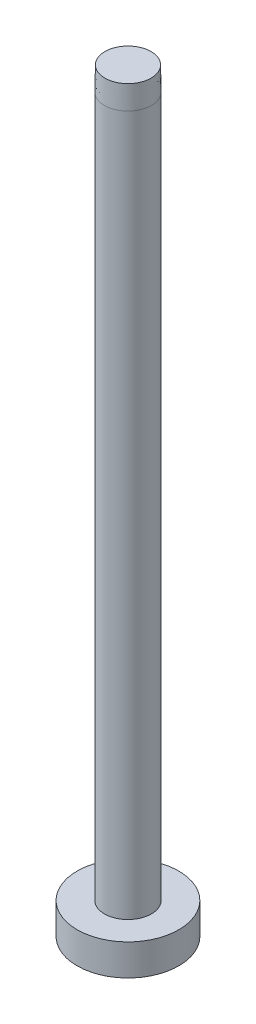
from build123d import *


with BuildPart() as part:
    # Esquisse1 → Base-R_volution (revolve)
    with BuildSketch(Plane.XY, mode=Mode.PRIVATE) as base_r_volution_sk:
        Polygon((0, 0), (-6.5, 0), (-6.5, 4), (-3, 4), (-3, 93.5), (-2.947634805, 96.5), (0, 96.5), align=None)
    revolve(base_r_volution_sk.sketch.rotate(Axis((0, 49.432307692, 0), (0, -1, 0)), 270), axis=Axis((0, 49.432307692, 0), (0, -1, 0)))


solid = part.part
